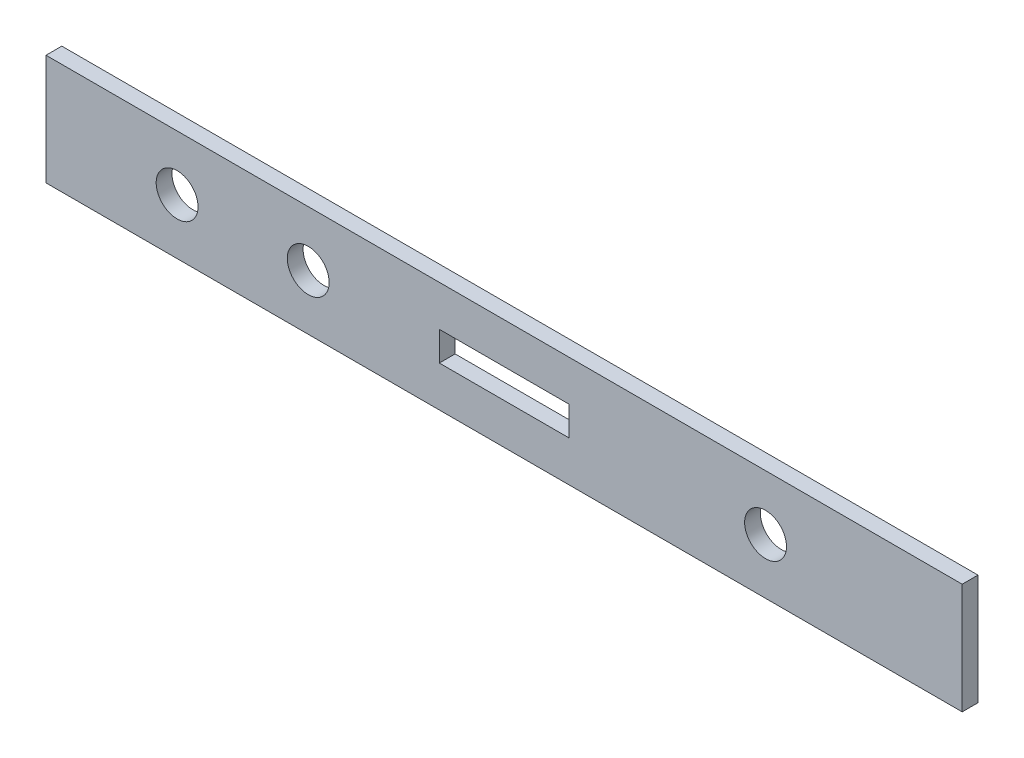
ISO-10303-21;
HEADER;
FILE_DESCRIPTION(('STEP AP214'),'2;1');
FILE_NAME('part.step','',(''),(''),'','','');
FILE_SCHEMA(('AUTOMOTIVE_DESIGN { 1 0 10303 214 1 1 1 1 }'));
ENDSEC;
DATA;
#1=APPLICATION_CONTEXT('core data for automotive mechanical design processes');
#2=APPLICATION_PROTOCOL_DEFINITION('international standard','automotive_design',2000,#1);
#3=PRODUCT_CONTEXT('',#1,'mechanical');
#4=PRODUCT('Part','Part','',(#3));
#5=PRODUCT_RELATED_PRODUCT_CATEGORY('part','',(#4));
#6=PRODUCT_DEFINITION_FORMATION('','',#4);
#7=PRODUCT_DEFINITION_CONTEXT('part definition',#1,'design');
#8=PRODUCT_DEFINITION('design','',#6,#7);
#9=PRODUCT_DEFINITION_SHAPE('','',#8);
#10=(LENGTH_UNIT() NAMED_UNIT(*) SI_UNIT(.MILLI.,.METRE.));
#11=(NAMED_UNIT(*) PLANE_ANGLE_UNIT() SI_UNIT($,.RADIAN.));
#12=(NAMED_UNIT(*) SI_UNIT($,.STERADIAN.) SOLID_ANGLE_UNIT());
#13=UNCERTAINTY_MEASURE_WITH_UNIT(LENGTH_MEASURE(1.E-05),#10,'distance_accuracy_value','');
#14=(GEOMETRIC_REPRESENTATION_CONTEXT(3) GLOBAL_UNCERTAINTY_ASSIGNED_CONTEXT((#13)) GLOBAL_UNIT_ASSIGNED_CONTEXT((#10,
#11,#12)) REPRESENTATION_CONTEXT('',''));
#15=CARTESIAN_POINT('',(0.,0.,0.));
#16=DIRECTION('',(0.,0.,1.));
#17=DIRECTION('',(1.,0.,0.));
#18=AXIS2_PLACEMENT_3D('',#15,#16,#17);
#19=CARTESIAN_POINT('',(600.,-123.669438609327,162.578376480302));
#20=DIRECTION('',(0.,0.,1.));
#21=DIRECTION('',(0.,-1.,0.));
#22=AXIS2_PLACEMENT_3D('',#19,#20,#21);
#23=PLANE('',#22);
#24=CARTESIAN_POINT('',(93.,-158.669438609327,162.578376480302));
#25=DIRECTION('',(0.,0.,1.));
#26=DIRECTION('',(1.,0.,0.));
#27=AXIS2_PLACEMENT_3D('',#24,#25,#26);
#28=CIRCLE('',#27,13.25);
#29=CARTESIAN_POINT('',(106.25,-158.669438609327,162.578376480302));
#30=VERTEX_POINT('',#29);
#31=EDGE_CURVE('E134',#30,#30,#28,.T.);
#32=ORIENTED_EDGE('',*,*,#31,.T.);
#33=EDGE_LOOP('',(#32));
#34=FACE_BOUND('',#33,.T.);
#35=CARTESIAN_POINT('',(176.,-158.669438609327,162.578376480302));
#36=DIRECTION('',(0.,0.,1.));
#37=DIRECTION('',(1.,0.,0.));
#38=AXIS2_PLACEMENT_3D('',#35,#36,#37);
#39=CIRCLE('',#38,13.25);
#40=CARTESIAN_POINT('',(189.25,-158.669438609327,162.578376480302));
#41=VERTEX_POINT('',#40);
#42=EDGE_CURVE('E179',#41,#41,#39,.T.);
#43=ORIENTED_EDGE('',*,*,#42,.T.);
#44=EDGE_LOOP('',(#43));
#45=FACE_BOUND('',#44,.T.);
#46=CARTESIAN_POINT('',(465.5,-158.669438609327,162.578376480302));
#47=DIRECTION('',(0.,0.,1.));
#48=DIRECTION('',(1.,0.,0.));
#49=AXIS2_PLACEMENT_3D('',#46,#47,#48);
#50=CIRCLE('',#49,13.25);
#51=CARTESIAN_POINT('',(478.75,-158.669438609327,162.578376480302));
#52=VERTEX_POINT('',#51);
#53=EDGE_CURVE('E173',#52,#52,#50,.T.);
#54=ORIENTED_EDGE('',*,*,#53,.T.);
#55=EDGE_LOOP('',(#54));
#56=FACE_BOUND('',#55,.T.);
#57=DIRECTION('',(-1.,0.,0.));
#58=VECTOR('',#57,1.);
#59=CARTESIAN_POINT('',(259.,-149.419438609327,162.578376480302));
#60=LINE('',#59,#58);
#61=CARTESIAN_POINT('',(341.,-149.419438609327,162.578376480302));
#62=VERTEX_POINT('',#61);
#63=CARTESIAN_POINT('',(259.,-149.419438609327,162.578376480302));
#64=VERTEX_POINT('',#63);
#65=EDGE_CURVE('E143',#62,#64,#60,.T.);
#66=ORIENTED_EDGE('',*,*,#65,.T.);
#67=DIRECTION('',(0.,-1.,0.));
#68=VECTOR('',#67,1.);
#69=CARTESIAN_POINT('',(259.,-149.419438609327,162.578376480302));
#70=LINE('',#69,#68);
#71=CARTESIAN_POINT('',(259.,-167.919438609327,162.578376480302));
#72=VERTEX_POINT('',#71);
#73=EDGE_CURVE('E152',#64,#72,#70,.T.);
#74=ORIENTED_EDGE('',*,*,#73,.T.);
#75=DIRECTION('',(1.,0.,0.));
#76=VECTOR('',#75,1.);
#77=CARTESIAN_POINT('',(259.,-167.919438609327,162.578376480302));
#78=LINE('',#77,#76);
#79=CARTESIAN_POINT('',(341.,-167.919438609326,162.578376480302));
#80=VERTEX_POINT('',#79);
#81=EDGE_CURVE('E163',#72,#80,#78,.T.);
#82=ORIENTED_EDGE('',*,*,#81,.T.);
#83=DIRECTION('',(0.,1.,0.));
#84=VECTOR('',#83,1.);
#85=CARTESIAN_POINT('',(341.,-149.419438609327,162.578376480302));
#86=LINE('',#85,#84);
#87=EDGE_CURVE('E47',#80,#62,#86,.T.);
#88=ORIENTED_EDGE('',*,*,#87,.T.);
#89=EDGE_LOOP('',(#66,#74,#82,#88));
#90=FACE_BOUND('',#89,.T.);
#91=DIRECTION('',(-1.,0.,0.));
#92=VECTOR('',#91,1.);
#93=CARTESIAN_POINT('',(600.,-193.669438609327,162.578376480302));
#94=LINE('',#93,#92);
#95=CARTESIAN_POINT('',(590.,-193.669438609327,162.578376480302));
#96=VERTEX_POINT('',#95);
#97=CARTESIAN_POINT('',(10.,-193.669438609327,162.578376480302));
#98=VERTEX_POINT('',#97);
#99=EDGE_CURVE('E114',#96,#98,#94,.T.);
#100=ORIENTED_EDGE('',*,*,#99,.T.);
#101=DIRECTION('',(0.,1.,0.));
#102=VECTOR('',#101,1.);
#103=CARTESIAN_POINT('',(10.,-123.669438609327,162.578376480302));
#104=LINE('',#103,#102);
#105=CARTESIAN_POINT('',(10.,-123.669438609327,162.578376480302));
#106=VERTEX_POINT('',#105);
#107=EDGE_CURVE('E99',#98,#106,#104,.T.);
#108=ORIENTED_EDGE('',*,*,#107,.T.);
#109=DIRECTION('',(-1.,0.,0.));
#110=VECTOR('',#109,1.);
#111=CARTESIAN_POINT('',(600.,-123.669438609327,162.578376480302));
#112=LINE('',#111,#110);
#113=CARTESIAN_POINT('',(590.,-123.669438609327,162.578376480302));
#114=VERTEX_POINT('',#113);
#115=EDGE_CURVE('E11',#114,#106,#112,.T.);
#116=ORIENTED_EDGE('',*,*,#115,.F.);
#117=DIRECTION('',(0.,-1.,0.));
#118=VECTOR('',#117,1.);
#119=CARTESIAN_POINT('',(590.,-120.064864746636,162.578376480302));
#120=LINE('',#119,#118);
#121=EDGE_CURVE('E133',#114,#96,#120,.T.);
#122=ORIENTED_EDGE('',*,*,#121,.T.);
#123=EDGE_LOOP('',(#100,#108,#116,#122));
#124=FACE_BOUND('',#123,.T.);
#125=ADVANCED_FACE('F33',(#34,#45,#56,#90,#124),#23,.F.);
#126=CARTESIAN_POINT('',(600.,-123.669438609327,162.578376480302));
#127=DIRECTION('',(0.,-1.,0.));
#128=DIRECTION('',(0.,0.,-1.));
#129=AXIS2_PLACEMENT_3D('',#126,#127,#128);
#130=PLANE('',#129);
#131=ORIENTED_EDGE('',*,*,#115,.T.);
#132=DIRECTION('',(0.,0.,1.));
#133=VECTOR('',#132,1.);
#134=CARTESIAN_POINT('',(10.,-123.669438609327,162.578376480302));
#135=LINE('',#134,#133);
#136=CARTESIAN_POINT('',(10.,-123.669438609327,172.578376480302));
#137=VERTEX_POINT('',#136);
#138=EDGE_CURVE('E96',#106,#137,#135,.T.);
#139=ORIENTED_EDGE('',*,*,#138,.T.);
#140=DIRECTION('',(-1.,0.,0.));
#141=VECTOR('',#140,1.);
#142=CARTESIAN_POINT('',(600.,-123.669438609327,172.578376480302));
#143=LINE('',#142,#141);
#144=CARTESIAN_POINT('',(590.,-123.669438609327,172.578376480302));
#145=VERTEX_POINT('',#144);
#146=EDGE_CURVE('E40',#145,#137,#143,.T.);
#147=ORIENTED_EDGE('',*,*,#146,.F.);
#148=DIRECTION('',(0.,0.,-1.));
#149=VECTOR('',#148,1.);
#150=CARTESIAN_POINT('',(590.,-123.669438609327,162.578376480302));
#151=LINE('',#150,#149);
#152=EDGE_CURVE('E106',#145,#114,#151,.T.);
#153=ORIENTED_EDGE('',*,*,#152,.T.);
#154=EDGE_LOOP('',(#131,#139,#147,#153));
#155=FACE_BOUND('',#154,.T.);
#156=ADVANCED_FACE('F117',(#155),#130,.F.);
#157=CARTESIAN_POINT('',(600.,-123.669438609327,172.578376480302));
#158=DIRECTION('',(0.,0.,-1.));
#159=DIRECTION('',(-1.,0.,0.));
#160=AXIS2_PLACEMENT_3D('',#157,#158,#159);
#161=PLANE('',#160);
#162=CARTESIAN_POINT('',(93.,-158.669438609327,172.578376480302));
#163=DIRECTION('',(0.,0.,1.));
#164=DIRECTION('',(1.,0.,0.));
#165=AXIS2_PLACEMENT_3D('',#162,#163,#164);
#166=CIRCLE('',#165,13.25);
#167=CARTESIAN_POINT('',(106.25,-158.669438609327,172.578376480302));
#168=VERTEX_POINT('',#167);
#169=EDGE_CURVE('E137',#168,#168,#166,.T.);
#170=ORIENTED_EDGE('',*,*,#169,.F.);
#171=EDGE_LOOP('',(#170));
#172=FACE_BOUND('',#171,.T.);
#173=CARTESIAN_POINT('',(176.,-158.669438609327,172.578376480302));
#174=DIRECTION('',(0.,0.,1.));
#175=DIRECTION('',(1.,0.,0.));
#176=AXIS2_PLACEMENT_3D('',#173,#174,#175);
#177=CIRCLE('',#176,13.25);
#178=CARTESIAN_POINT('',(189.25,-158.669438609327,172.578376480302));
#179=VERTEX_POINT('',#178);
#180=EDGE_CURVE('E176',#179,#179,#177,.T.);
#181=ORIENTED_EDGE('',*,*,#180,.F.);
#182=EDGE_LOOP('',(#181));
#183=FACE_BOUND('',#182,.T.);
#184=CARTESIAN_POINT('',(465.5,-158.669438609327,172.578376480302));
#185=DIRECTION('',(0.,0.,1.));
#186=DIRECTION('',(1.,0.,0.));
#187=AXIS2_PLACEMENT_3D('',#184,#185,#186);
#188=CIRCLE('',#187,13.25);
#189=CARTESIAN_POINT('',(478.75,-158.669438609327,172.578376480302));
#190=VERTEX_POINT('',#189);
#191=EDGE_CURVE('E170',#190,#190,#188,.T.);
#192=ORIENTED_EDGE('',*,*,#191,.F.);
#193=EDGE_LOOP('',(#192));
#194=FACE_BOUND('',#193,.T.);
#195=DIRECTION('',(1.,0.,0.));
#196=VECTOR('',#195,1.);
#197=CARTESIAN_POINT('',(259.,-167.919438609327,172.578376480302));
#198=LINE('',#197,#196);
#199=CARTESIAN_POINT('',(259.,-167.919438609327,172.578376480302));
#200=VERTEX_POINT('',#199);
#201=CARTESIAN_POINT('',(341.,-167.919438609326,172.578376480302));
#202=VERTEX_POINT('',#201);
#203=EDGE_CURVE('E156',#200,#202,#198,.T.);
#204=ORIENTED_EDGE('',*,*,#203,.F.);
#205=DIRECTION('',(0.,-1.,0.));
#206=VECTOR('',#205,1.);
#207=CARTESIAN_POINT('',(259.,-149.419438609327,172.578376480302));
#208=LINE('',#207,#206);
#209=CARTESIAN_POINT('',(259.,-149.419438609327,172.578376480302));
#210=VERTEX_POINT('',#209);
#211=EDGE_CURVE('E55',#210,#200,#208,.T.);
#212=ORIENTED_EDGE('',*,*,#211,.F.);
#213=DIRECTION('',(-1.,0.,0.));
#214=VECTOR('',#213,1.);
#215=CARTESIAN_POINT('',(259.,-149.419438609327,172.578376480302));
#216=LINE('',#215,#214);
#217=CARTESIAN_POINT('',(341.,-149.419438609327,172.578376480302));
#218=VERTEX_POINT('',#217);
#219=EDGE_CURVE('E149',#218,#210,#216,.T.);
#220=ORIENTED_EDGE('',*,*,#219,.F.);
#221=DIRECTION('',(0.,1.,0.));
#222=VECTOR('',#221,1.);
#223=CARTESIAN_POINT('',(341.,-149.419438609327,172.578376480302));
#224=LINE('',#223,#222);
#225=EDGE_CURVE('E153',#202,#218,#224,.T.);
#226=ORIENTED_EDGE('',*,*,#225,.F.);
#227=EDGE_LOOP('',(#204,#212,#220,#226));
#228=FACE_BOUND('',#227,.T.);
#229=ORIENTED_EDGE('',*,*,#146,.T.);
#230=DIRECTION('',(0.,1.,0.));
#231=VECTOR('',#230,1.);
#232=CARTESIAN_POINT('',(10.,-123.669438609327,172.578376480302));
#233=LINE('',#232,#231);
#234=CARTESIAN_POINT('',(10.,-193.669438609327,172.578376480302));
#235=VERTEX_POINT('',#234);
#236=EDGE_CURVE('E102',#235,#137,#233,.T.);
#237=ORIENTED_EDGE('',*,*,#236,.F.);
#238=DIRECTION('',(-1.,0.,0.));
#239=VECTOR('',#238,1.);
#240=CARTESIAN_POINT('',(600.,-193.669438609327,172.578376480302));
#241=LINE('',#240,#239);
#242=CARTESIAN_POINT('',(590.,-193.669438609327,172.578376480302));
#243=VERTEX_POINT('',#242);
#244=EDGE_CURVE('E121',#243,#235,#241,.T.);
#245=ORIENTED_EDGE('',*,*,#244,.F.);
#246=DIRECTION('',(0.,-1.,0.));
#247=VECTOR('',#246,1.);
#248=CARTESIAN_POINT('',(590.,-120.064864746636,172.578376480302));
#249=LINE('',#248,#247);
#250=EDGE_CURVE('E131',#145,#243,#249,.T.);
#251=ORIENTED_EDGE('',*,*,#250,.F.);
#252=EDGE_LOOP('',(#229,#237,#245,#251));
#253=FACE_BOUND('',#252,.T.);
#254=ADVANCED_FACE('F129',(#172,#183,#194,#228,#253),#161,.F.);
#255=CARTESIAN_POINT('',(600.,-193.669438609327,162.578376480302));
#256=DIRECTION('',(0.,1.,0.));
#257=DIRECTION('',(0.,0.,1.));
#258=AXIS2_PLACEMENT_3D('',#255,#256,#257);
#259=PLANE('',#258);
#260=ORIENTED_EDGE('',*,*,#244,.T.);
#261=DIRECTION('',(0.,0.,1.));
#262=VECTOR('',#261,1.);
#263=CARTESIAN_POINT('',(10.,-193.669438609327,162.578376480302));
#264=LINE('',#263,#262);
#265=EDGE_CURVE('E107',#98,#235,#264,.T.);
#266=ORIENTED_EDGE('',*,*,#265,.F.);
#267=ORIENTED_EDGE('',*,*,#99,.F.);
#268=DIRECTION('',(0.,0.,1.));
#269=VECTOR('',#268,1.);
#270=CARTESIAN_POINT('',(590.,-193.669438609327,162.578376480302));
#271=LINE('',#270,#269);
#272=EDGE_CURVE('E124',#96,#243,#271,.T.);
#273=ORIENTED_EDGE('',*,*,#272,.T.);
#274=EDGE_LOOP('',(#260,#266,#267,#273));
#275=FACE_BOUND('',#274,.T.);
#276=ADVANCED_FACE('F189',(#275),#259,.F.);
#277=CARTESIAN_POINT('',(590.,-120.064864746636,162.578376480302));
#278=DIRECTION('',(-1.,0.,0.));
#279=DIRECTION('',(0.,0.,1.));
#280=AXIS2_PLACEMENT_3D('',#277,#278,#279);
#281=PLANE('',#280);
#282=ORIENTED_EDGE('',*,*,#250,.T.);
#283=ORIENTED_EDGE('',*,*,#272,.F.);
#284=ORIENTED_EDGE('',*,*,#121,.F.);
#285=ORIENTED_EDGE('',*,*,#152,.F.);
#286=EDGE_LOOP('',(#282,#283,#284,#285));
#287=FACE_BOUND('',#286,.T.);
#288=ADVANCED_FACE('F240',(#287),#281,.F.);
#289=CARTESIAN_POINT('',(10.,-123.669438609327,162.578376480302));
#290=DIRECTION('',(1.,0.,0.));
#291=DIRECTION('',(0.,0.,-1.));
#292=AXIS2_PLACEMENT_3D('',#289,#290,#291);
#293=PLANE('',#292);
#294=ORIENTED_EDGE('',*,*,#236,.T.);
#295=ORIENTED_EDGE('',*,*,#138,.F.);
#296=ORIENTED_EDGE('',*,*,#107,.F.);
#297=ORIENTED_EDGE('',*,*,#265,.T.);
#298=EDGE_LOOP('',(#294,#295,#296,#297));
#299=FACE_BOUND('',#298,.T.);
#300=ADVANCED_FACE('F98',(#299),#293,.F.);
#301=CARTESIAN_POINT('',(259.,-149.419438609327,162.578376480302));
#302=DIRECTION('',(-1.,0.,0.));
#303=DIRECTION('',(0.,0.,1.));
#304=AXIS2_PLACEMENT_3D('',#301,#302,#303);
#305=PLANE('',#304);
#306=ORIENTED_EDGE('',*,*,#211,.T.);
#307=DIRECTION('',(0.,0.,1.));
#308=VECTOR('',#307,1.);
#309=CARTESIAN_POINT('',(259.,-167.919438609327,162.578376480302));
#310=LINE('',#309,#308);
#311=EDGE_CURVE('E140',#72,#200,#310,.T.);
#312=ORIENTED_EDGE('',*,*,#311,.F.);
#313=ORIENTED_EDGE('',*,*,#73,.F.);
#314=DIRECTION('',(0.,0.,1.));
#315=VECTOR('',#314,1.);
#316=CARTESIAN_POINT('',(259.,-149.419438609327,162.578376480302));
#317=LINE('',#316,#315);
#318=EDGE_CURVE('E147',#64,#210,#317,.T.);
#319=ORIENTED_EDGE('',*,*,#318,.T.);
#320=EDGE_LOOP('',(#306,#312,#313,#319));
#321=FACE_BOUND('',#320,.T.);
#322=ADVANCED_FACE('F202',(#321),#305,.F.);
#323=CARTESIAN_POINT('',(259.,-149.419438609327,162.578376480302));
#324=DIRECTION('',(0.,1.,0.));
#325=DIRECTION('',(-1.,0.,0.));
#326=AXIS2_PLACEMENT_3D('',#323,#324,#325);
#327=PLANE('',#326);
#328=ORIENTED_EDGE('',*,*,#219,.T.);
#329=ORIENTED_EDGE('',*,*,#318,.F.);
#330=ORIENTED_EDGE('',*,*,#65,.F.);
#331=DIRECTION('',(0.,0.,1.));
#332=VECTOR('',#331,1.);
#333=CARTESIAN_POINT('',(341.,-149.419438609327,162.578376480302));
#334=LINE('',#333,#332);
#335=EDGE_CURVE('E145',#62,#218,#334,.T.);
#336=ORIENTED_EDGE('',*,*,#335,.T.);
#337=EDGE_LOOP('',(#328,#329,#330,#336));
#338=FACE_BOUND('',#337,.T.);
#339=ADVANCED_FACE('F206',(#338),#327,.F.);
#340=CARTESIAN_POINT('',(341.,-149.419438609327,162.578376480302));
#341=DIRECTION('',(1.,0.,0.));
#342=DIRECTION('',(0.,0.,-1.));
#343=AXIS2_PLACEMENT_3D('',#340,#341,#342);
#344=PLANE('',#343);
#345=ORIENTED_EDGE('',*,*,#225,.T.);
#346=ORIENTED_EDGE('',*,*,#335,.F.);
#347=ORIENTED_EDGE('',*,*,#87,.F.);
#348=DIRECTION('',(0.,0.,1.));
#349=VECTOR('',#348,1.);
#350=CARTESIAN_POINT('',(341.,-167.919438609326,162.578376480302));
#351=LINE('',#350,#349);
#352=EDGE_CURVE('E142',#80,#202,#351,.T.);
#353=ORIENTED_EDGE('',*,*,#352,.T.);
#354=EDGE_LOOP('',(#345,#346,#347,#353));
#355=FACE_BOUND('',#354,.T.);
#356=ADVANCED_FACE('F207',(#355),#344,.F.);
#357=CARTESIAN_POINT('',(259.,-167.919438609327,162.578376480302));
#358=DIRECTION('',(0.,-1.,0.));
#359=DIRECTION('',(1.,0.,0.));
#360=AXIS2_PLACEMENT_3D('',#357,#358,#359);
#361=PLANE('',#360);
#362=ORIENTED_EDGE('',*,*,#203,.T.);
#363=ORIENTED_EDGE('',*,*,#352,.F.);
#364=ORIENTED_EDGE('',*,*,#81,.F.);
#365=ORIENTED_EDGE('',*,*,#311,.T.);
#366=EDGE_LOOP('',(#362,#363,#364,#365));
#367=FACE_BOUND('',#366,.T.);
#368=ADVANCED_FACE('F199',(#367),#361,.F.);
#369=CARTESIAN_POINT('',(465.5,-158.669438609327,162.578376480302));
#370=DIRECTION('',(0.,0.,1.));
#371=DIRECTION('',(1.,0.,0.));
#372=AXIS2_PLACEMENT_3D('',#369,#370,#371);
#373=CYLINDRICAL_SURFACE('',#372,13.25);
#374=ORIENTED_EDGE('',*,*,#53,.F.);
#375=EDGE_LOOP('',(#374));
#376=FACE_BOUND('',#375,.T.);
#377=ORIENTED_EDGE('',*,*,#191,.T.);
#378=EDGE_LOOP('',(#377));
#379=FACE_BOUND('',#378,.T.);
#380=ADVANCED_FACE('F214',(#376,#379),#373,.F.);
#381=CARTESIAN_POINT('',(176.,-158.669438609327,162.578376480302));
#382=DIRECTION('',(0.,0.,1.));
#383=DIRECTION('',(1.,0.,0.));
#384=AXIS2_PLACEMENT_3D('',#381,#382,#383);
#385=CYLINDRICAL_SURFACE('',#384,13.25);
#386=ORIENTED_EDGE('',*,*,#42,.F.);
#387=EDGE_LOOP('',(#386));
#388=FACE_BOUND('',#387,.T.);
#389=ORIENTED_EDGE('',*,*,#180,.T.);
#390=EDGE_LOOP('',(#389));
#391=FACE_BOUND('',#390,.T.);
#392=ADVANCED_FACE('F230',(#388,#391),#385,.F.);
#393=CARTESIAN_POINT('',(93.,-158.669438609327,162.578376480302));
#394=DIRECTION('',(0.,0.,1.));
#395=DIRECTION('',(1.,0.,0.));
#396=AXIS2_PLACEMENT_3D('',#393,#394,#395);
#397=CYLINDRICAL_SURFACE('',#396,13.25);
#398=ORIENTED_EDGE('',*,*,#31,.F.);
#399=EDGE_LOOP('',(#398));
#400=FACE_BOUND('',#399,.T.);
#401=ORIENTED_EDGE('',*,*,#169,.T.);
#402=EDGE_LOOP('',(#401));
#403=FACE_BOUND('',#402,.T.);
#404=ADVANCED_FACE('F185',(#400,#403),#397,.F.);
#405=CLOSED_SHELL('',(#125,#156,#254,#276,#288,#300,#322,#339,#356,#368,#380,#392,#404));
#406=MANIFOLD_SOLID_BREP('B2',#405);
#407=ADVANCED_BREP_SHAPE_REPRESENTATION('',(#18,#406),#14);
#408=SHAPE_DEFINITION_REPRESENTATION(#9,#407);
ENDSEC;
END-ISO-10303-21;
